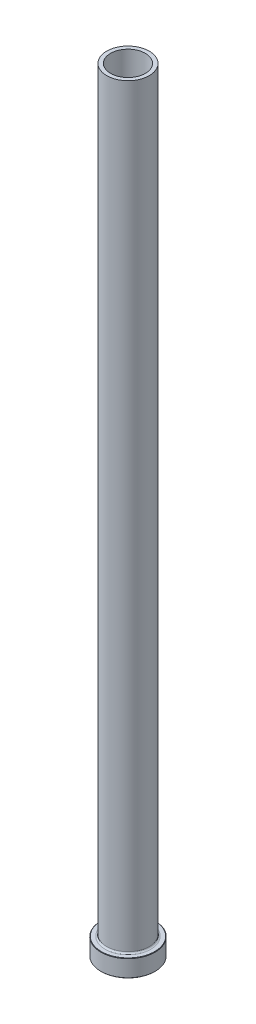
ISO-10303-21;
HEADER;
FILE_DESCRIPTION(('STEP AP214'),'2;1');
FILE_NAME('part.step','',(''),(''),'','','');
FILE_SCHEMA(('AUTOMOTIVE_DESIGN { 1 0 10303 214 1 1 1 1 }'));
ENDSEC;
DATA;
#1=APPLICATION_CONTEXT('core data for automotive mechanical design processes');
#2=APPLICATION_PROTOCOL_DEFINITION('international standard','automotive_design',2000,#1);
#3=PRODUCT_CONTEXT('',#1,'mechanical');
#4=PRODUCT('Part','Part','',(#3));
#5=PRODUCT_RELATED_PRODUCT_CATEGORY('part','',(#4));
#6=PRODUCT_DEFINITION_FORMATION('','',#4);
#7=PRODUCT_DEFINITION_CONTEXT('part definition',#1,'design');
#8=PRODUCT_DEFINITION('design','',#6,#7);
#9=PRODUCT_DEFINITION_SHAPE('','',#8);
#10=(LENGTH_UNIT() NAMED_UNIT(*) SI_UNIT(.MILLI.,.METRE.));
#11=(NAMED_UNIT(*) PLANE_ANGLE_UNIT() SI_UNIT($,.RADIAN.));
#12=(NAMED_UNIT(*) SI_UNIT($,.STERADIAN.) SOLID_ANGLE_UNIT());
#13=UNCERTAINTY_MEASURE_WITH_UNIT(LENGTH_MEASURE(1.E-05),#10,'distance_accuracy_value','');
#14=(GEOMETRIC_REPRESENTATION_CONTEXT(3) GLOBAL_UNCERTAINTY_ASSIGNED_CONTEXT((#13)) GLOBAL_UNIT_ASSIGNED_CONTEXT((#10,
#11,#12)) REPRESENTATION_CONTEXT('',''));
#15=CARTESIAN_POINT('',(0.,0.,0.));
#16=DIRECTION('',(0.,0.,1.));
#17=DIRECTION('',(1.,0.,0.));
#18=AXIS2_PLACEMENT_3D('',#15,#16,#17);
#19=CARTESIAN_POINT('',(0.,92.1876809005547,0.));
#20=DIRECTION('',(0.,1.,0.));
#21=DIRECTION('',(0.,0.,1.));
#22=AXIS2_PLACEMENT_3D('',#19,#20,#21);
#23=CYLINDRICAL_SURFACE('',#22,9.00000000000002);
#24=CARTESIAN_POINT('',(0.,400.,0.));
#25=DIRECTION('',(0.,1.,0.));
#26=DIRECTION('',(0.,0.,1.));
#27=AXIS2_PLACEMENT_3D('',#24,#25,#26);
#28=CIRCLE('',#27,9.00000000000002);
#29=CARTESIAN_POINT('',(0.,400.,9.00000000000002));
#30=VERTEX_POINT('',#29);
#31=EDGE_CURVE('E62',#30,#30,#28,.T.);
#32=ORIENTED_EDGE('',*,*,#31,.T.);
#33=EDGE_LOOP('',(#32));
#34=FACE_BOUND('',#33,.T.);
#35=CARTESIAN_POINT('',(0.,345.,0.));
#36=DIRECTION('',(0.,1.,0.));
#37=DIRECTION('',(0.,0.,1.));
#38=AXIS2_PLACEMENT_3D('',#35,#36,#37);
#39=CIRCLE('',#38,9.00000000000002);
#40=CARTESIAN_POINT('',(0.,345.,9.00000000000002));
#41=VERTEX_POINT('',#40);
#42=EDGE_CURVE('E71',#41,#41,#39,.T.);
#43=ORIENTED_EDGE('',*,*,#42,.F.);
#44=EDGE_LOOP('',(#43));
#45=FACE_BOUND('',#44,.T.);
#46=ADVANCED_FACE('F30',(#34,#45),#23,.F.);
#47=CARTESIAN_POINT('',(-9.00000000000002,400.,0.));
#48=DIRECTION('',(0.,1.,0.));
#49=DIRECTION('',(0.,0.,1.));
#50=AXIS2_PLACEMENT_3D('',#47,#48,#49);
#51=PLANE('',#50);
#52=CARTESIAN_POINT('',(0.,400.,0.));
#53=DIRECTION('',(0.,1.,0.));
#54=DIRECTION('',(0.,0.,1.));
#55=AXIS2_PLACEMENT_3D('',#52,#53,#54);
#56=CIRCLE('',#55,11.);
#57=CARTESIAN_POINT('',(0.,400.,11.));
#58=VERTEX_POINT('',#57);
#59=EDGE_CURVE('E65',#58,#58,#56,.T.);
#60=ORIENTED_EDGE('',*,*,#59,.T.);
#61=EDGE_LOOP('',(#60));
#62=FACE_BOUND('',#61,.T.);
#63=ORIENTED_EDGE('',*,*,#31,.F.);
#64=EDGE_LOOP('',(#63));
#65=FACE_BOUND('',#64,.T.);
#66=ADVANCED_FACE('F79',(#62,#65),#51,.T.);
#67=CARTESIAN_POINT('',(0.,92.1876809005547,0.));
#68=DIRECTION('',(0.,1.,0.));
#69=DIRECTION('',(0.,0.,1.));
#70=AXIS2_PLACEMENT_3D('',#67,#68,#69);
#71=CYLINDRICAL_SURFACE('',#70,11.);
#72=CARTESIAN_POINT('',(0.,9.8,0.));
#73=DIRECTION('',(0.,1.,0.));
#74=DIRECTION('',(0.,0.,1.));
#75=AXIS2_PLACEMENT_3D('',#72,#73,#74);
#76=CIRCLE('',#75,11.);
#77=CARTESIAN_POINT('',(0.,9.8,11.));
#78=VERTEX_POINT('',#77);
#79=EDGE_CURVE('E59',#78,#78,#76,.T.);
#80=ORIENTED_EDGE('',*,*,#79,.T.);
#81=EDGE_LOOP('',(#80));
#82=FACE_BOUND('',#81,.T.);
#83=ORIENTED_EDGE('',*,*,#59,.F.);
#84=EDGE_LOOP('',(#83));
#85=FACE_BOUND('',#84,.T.);
#86=ADVANCED_FACE('F85',(#82,#85),#71,.T.);
#87=CARTESIAN_POINT('',(-11.,9.,0.));
#88=DIRECTION('',(0.,1.,0.));
#89=DIRECTION('',(0.,0.,1.));
#90=AXIS2_PLACEMENT_3D('',#87,#88,#89);
#91=PLANE('',#90);
#92=CARTESIAN_POINT('',(0.,9.,0.));
#93=DIRECTION('',(0.,1.,0.));
#94=DIRECTION('',(0.,0.,1.));
#95=AXIS2_PLACEMENT_3D('',#92,#93,#94);
#96=CIRCLE('',#95,13.8);
#97=CARTESIAN_POINT('',(0.,9.,13.8));
#98=VERTEX_POINT('',#97);
#99=EDGE_CURVE('E53',#98,#98,#96,.T.);
#100=ORIENTED_EDGE('',*,*,#99,.T.);
#101=EDGE_LOOP('',(#100));
#102=FACE_BOUND('',#101,.T.);
#103=CARTESIAN_POINT('',(0.,9.,0.));
#104=DIRECTION('',(0.,1.,0.));
#105=DIRECTION('',(0.,0.,1.));
#106=AXIS2_PLACEMENT_3D('',#103,#104,#105);
#107=CIRCLE('',#106,11.8);
#108=CARTESIAN_POINT('',(0.,9.,11.8));
#109=VERTEX_POINT('',#108);
#110=EDGE_CURVE('E56',#109,#109,#107,.F.);
#111=ORIENTED_EDGE('',*,*,#110,.T.);
#112=EDGE_LOOP('',(#111));
#113=FACE_BOUND('',#112,.T.);
#114=ADVANCED_FACE('F111',(#102,#113),#91,.T.);
#115=CARTESIAN_POINT('',(0.,92.1876809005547,0.));
#116=DIRECTION('',(0.,1.,0.));
#117=DIRECTION('',(0.,0.,1.));
#118=AXIS2_PLACEMENT_3D('',#115,#116,#117);
#119=CYLINDRICAL_SURFACE('',#118,14.);
#120=CARTESIAN_POINT('',(0.,8.80000000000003,0.));
#121=DIRECTION('',(0.,1.,0.));
#122=DIRECTION('',(0.,0.,1.));
#123=AXIS2_PLACEMENT_3D('',#120,#121,#122);
#124=CIRCLE('',#123,14.);
#125=CARTESIAN_POINT('',(0.,8.80000000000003,14.));
#126=VERTEX_POINT('',#125);
#127=EDGE_CURVE('E45',#126,#126,#124,.F.);
#128=ORIENTED_EDGE('',*,*,#127,.T.);
#129=EDGE_LOOP('',(#128));
#130=FACE_BOUND('',#129,.T.);
#131=CARTESIAN_POINT('',(0.,0.200000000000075,0.));
#132=DIRECTION('',(0.,-1.,0.));
#133=DIRECTION('',(0.,0.,-1.));
#134=AXIS2_PLACEMENT_3D('',#131,#132,#133);
#135=CIRCLE('',#134,14.);
#136=CARTESIAN_POINT('',(0.,0.200000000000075,-14.));
#137=VERTEX_POINT('',#136);
#138=EDGE_CURVE('E50',#137,#137,#135,.F.);
#139=ORIENTED_EDGE('',*,*,#138,.T.);
#140=EDGE_LOOP('',(#139));
#141=FACE_BOUND('',#140,.T.);
#142=ADVANCED_FACE('F108',(#130,#141),#119,.T.);
#143=CARTESIAN_POINT('',(-14.,0.,0.));
#144=DIRECTION('',(0.,-1.,0.));
#145=DIRECTION('',(0.,0.,-1.));
#146=AXIS2_PLACEMENT_3D('',#143,#144,#145);
#147=PLANE('',#146);
#148=CARTESIAN_POINT('',(0.,0.,0.));
#149=DIRECTION('',(0.,-1.,0.));
#150=DIRECTION('',(0.,0.,-1.));
#151=AXIS2_PLACEMENT_3D('',#148,#149,#150);
#152=CIRCLE('',#151,9.75000000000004);
#153=CARTESIAN_POINT('',(0.,0.,-9.75000000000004));
#154=VERTEX_POINT('',#153);
#155=EDGE_CURVE('E37',#154,#154,#152,.F.);
#156=ORIENTED_EDGE('',*,*,#155,.T.);
#157=EDGE_LOOP('',(#156));
#158=FACE_BOUND('',#157,.T.);
#159=CARTESIAN_POINT('',(0.,0.,0.));
#160=DIRECTION('',(0.,-1.,0.));
#161=DIRECTION('',(0.,0.,-1.));
#162=AXIS2_PLACEMENT_3D('',#159,#160,#161);
#163=CIRCLE('',#162,13.7999999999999);
#164=CARTESIAN_POINT('',(0.,0.,-13.7999999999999));
#165=VERTEX_POINT('',#164);
#166=EDGE_CURVE('E41',#165,#165,#163,.T.);
#167=ORIENTED_EDGE('',*,*,#166,.T.);
#168=EDGE_LOOP('',(#167));
#169=FACE_BOUND('',#168,.T.);
#170=ADVANCED_FACE('F110',(#158,#169),#147,.T.);
#171=CARTESIAN_POINT('',(0.,92.1876809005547,0.));
#172=DIRECTION('',(0.,1.,0.));
#173=DIRECTION('',(0.,0.,1.));
#174=AXIS2_PLACEMENT_3D('',#171,#172,#173);
#175=CYLINDRICAL_SURFACE('',#174,9.25000000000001);
#176=CARTESIAN_POINT('',(0.,0.5,0.));
#177=DIRECTION('',(0.,-1.,0.));
#178=DIRECTION('',(0.,0.,-1.));
#179=AXIS2_PLACEMENT_3D('',#176,#177,#178);
#180=CIRCLE('',#179,9.25000000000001);
#181=CARTESIAN_POINT('',(0.,0.5,-9.25000000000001));
#182=VERTEX_POINT('',#181);
#183=EDGE_CURVE('E10',#182,#182,#180,.T.);
#184=ORIENTED_EDGE('',*,*,#183,.T.);
#185=EDGE_LOOP('',(#184));
#186=FACE_BOUND('',#185,.T.);
#187=CARTESIAN_POINT('',(0.,333.,0.));
#188=DIRECTION('',(0.,1.,0.));
#189=DIRECTION('',(0.,0.,1.));
#190=AXIS2_PLACEMENT_3D('',#187,#188,#189);
#191=CIRCLE('',#190,9.25000000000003);
#192=CARTESIAN_POINT('',(0.,333.,9.25000000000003));
#193=VERTEX_POINT('',#192);
#194=EDGE_CURVE('E68',#193,#193,#191,.T.);
#195=ORIENTED_EDGE('',*,*,#194,.T.);
#196=EDGE_LOOP('',(#195));
#197=FACE_BOUND('',#196,.T.);
#198=ADVANCED_FACE('F118',(#186,#197),#175,.F.);
#199=CARTESIAN_POINT('',(0.,333.,0.));
#200=DIRECTION('',(0.,-1.,0.));
#201=DIRECTION('',(0.,0.,-1.));
#202=AXIS2_PLACEMENT_3D('',#199,#200,#201);
#203=CONICAL_SURFACE('',#202,9.25000000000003,0.0208303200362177);
#204=ORIENTED_EDGE('',*,*,#42,.T.);
#205=EDGE_LOOP('',(#204));
#206=FACE_BOUND('',#205,.T.);
#207=ORIENTED_EDGE('',*,*,#194,.F.);
#208=EDGE_LOOP('',(#207));
#209=FACE_BOUND('',#208,.T.);
#210=ADVANCED_FACE('F75',(#206,#209),#203,.F.);
#211=CARTESIAN_POINT('',(0.,9.8,0.));
#212=DIRECTION('',(0.,1.,0.));
#213=DIRECTION('',(0.,0.,1.));
#214=AXIS2_PLACEMENT_3D('',#211,#212,#213);
#215=TOROIDAL_SURFACE('',#214,11.8,0.8);
#216=ORIENTED_EDGE('',*,*,#110,.F.);
#217=EDGE_LOOP('',(#216));
#218=FACE_BOUND('',#217,.T.);
#219=ORIENTED_EDGE('',*,*,#79,.F.);
#220=EDGE_LOOP('',(#219));
#221=FACE_BOUND('',#220,.T.);
#222=ADVANCED_FACE('F90',(#218,#221),#215,.F.);
#223=CARTESIAN_POINT('',(0.,8.99999999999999,0.));
#224=DIRECTION('',(0.,-1.,0.));
#225=DIRECTION('',(0.,0.,-1.));
#226=AXIS2_PLACEMENT_3D('',#223,#224,#225);
#227=CONICAL_SURFACE('',#226,13.8,0.785398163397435);
#228=ORIENTED_EDGE('',*,*,#127,.F.);
#229=EDGE_LOOP('',(#228));
#230=FACE_BOUND('',#229,.T.);
#231=ORIENTED_EDGE('',*,*,#99,.F.);
#232=EDGE_LOOP('',(#231));
#233=FACE_BOUND('',#232,.T.);
#234=ADVANCED_FACE('F93',(#230,#233),#227,.T.);
#235=CARTESIAN_POINT('',(0.,0.200000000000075,0.));
#236=DIRECTION('',(0.,1.,0.));
#237=DIRECTION('',(0.,0.,1.));
#238=AXIS2_PLACEMENT_3D('',#235,#236,#237);
#239=CONICAL_SURFACE('',#238,14.,0.785398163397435);
#240=ORIENTED_EDGE('',*,*,#166,.F.);
#241=EDGE_LOOP('',(#240));
#242=FACE_BOUND('',#241,.T.);
#243=ORIENTED_EDGE('',*,*,#138,.F.);
#244=EDGE_LOOP('',(#243));
#245=FACE_BOUND('',#244,.T.);
#246=ADVANCED_FACE('F96',(#242,#245),#239,.T.);
#247=CARTESIAN_POINT('',(0.,0.,0.));
#248=DIRECTION('',(0.,-1.,0.));
#249=DIRECTION('',(0.,0.,-1.));
#250=AXIS2_PLACEMENT_3D('',#247,#248,#249);
#251=CONICAL_SURFACE('',#250,9.75000000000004,0.785398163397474);
#252=ORIENTED_EDGE('',*,*,#183,.F.);
#253=EDGE_LOOP('',(#252));
#254=FACE_BOUND('',#253,.T.);
#255=ORIENTED_EDGE('',*,*,#155,.F.);
#256=EDGE_LOOP('',(#255));
#257=FACE_BOUND('',#256,.T.);
#258=ADVANCED_FACE('F32',(#254,#257),#251,.F.);
#259=CLOSED_SHELL('',(#46,#66,#86,#114,#142,#170,#198,#210,#222,#234,#246,#258));
#260=MANIFOLD_SOLID_BREP('B2',#259);
#261=ADVANCED_BREP_SHAPE_REPRESENTATION('',(#18,#260),#14);
#262=SHAPE_DEFINITION_REPRESENTATION(#9,#261);
ENDSEC;
END-ISO-10303-21;
